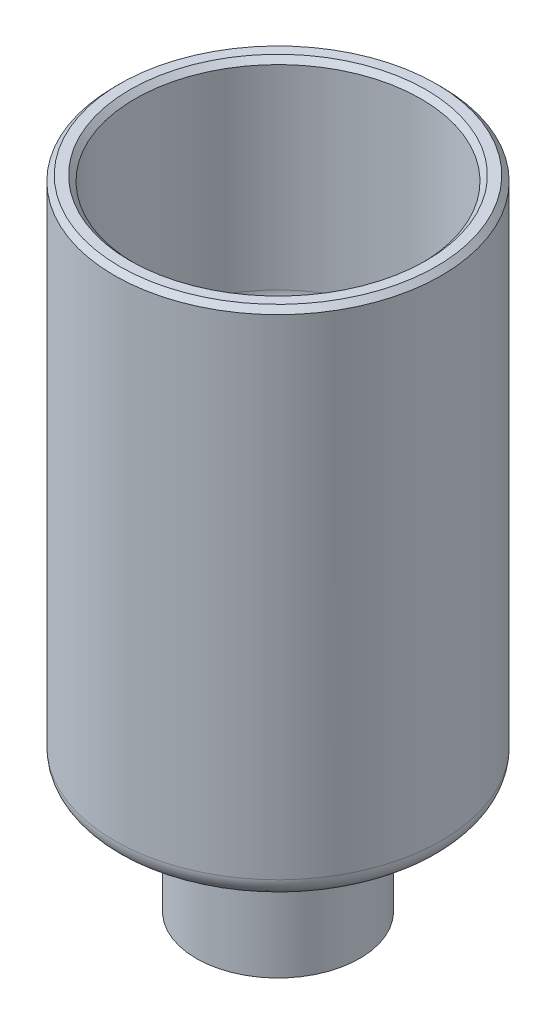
from build123d import *

# Parameters (mm, degrees)
SKETCH2_R          = 0.3175
CUT_EXTRUDE2_DEPTH = 3.175
CHAMFER1_SIZE      = 0.2032


with BuildPart() as part:
    # Sketch1 → Revolve1 (revolve)
    with BuildSketch(Plane.XY, mode=Mode.PRIVATE) as revolve1_sk:
        with BuildLine():
            Line((1.7907, 0), (1.7907, 8.258712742))
            Line((1.7907, 8.258712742), (2.7051, 9.8425))
            Line((2.7051, 9.8425), (2.7051, 16.1925))
            Line((2.7051, 16.1925), (4.7625, 16.1925))
            ThreePointArc((4.7625, 16.1925), (5.31927588, 16.42312412), (5.5499, 16.9799))
            Line((5.5499, 16.9799), (5.5499, 24.765))
            Line((5.5499, 24.765), (6.35, 24.765))
            Line((6.35, 24.765), (6.35, 5.5499))
            ThreePointArc((6.35, 5.5499), (6.244508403, 5.1562), (5.9563, 4.867991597))
            Line((5.9563, 4.867991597), (5.9563, 6.0325))
            Line((5.9563, 6.0325), (3.8227, 6.0325))
            Line((3.8227, 6.0325), (3.8227, 4.7625))
            Line((3.8227, 4.7625), (2.6162, 4.7625))
            Line((2.6162, 4.7625), (2.6162, 3.4925))
            Line((2.6162, 3.4925), (3.175, 3.4925))
            Line((3.175, 3.4925), (3.175, 0))
            Line((3.175, 0), (1.7907, 0))
        make_face()
    revolve(revolve1_sk.sketch.rotate(Axis((0, 0, 0), (0, -1, 0)), 90), axis=Axis((0, 0, 0), (0, -1, 0)))

    # Sketch2 → Cut-Extrude2 (cut)
    with BuildSketch(Plane.XZ):
        with Locations(Location((2.286, 0, 0), (0, 0, 270))):
            Circle(SKETCH2_R)
    extrude(amount=-CUT_EXTRUDE2_DEPTH, mode=Mode.SUBTRACT)

    # Chamfer1
    chamfer1_edges = [part.edges().sort_by_distance(p)[0] for p in [
        (0, 24.765, -6.35),
        (0, 24.765, -5.5499),
    ]]
    chamfer(chamfer1_edges, length=CHAMFER1_SIZE)


solid = part.part
